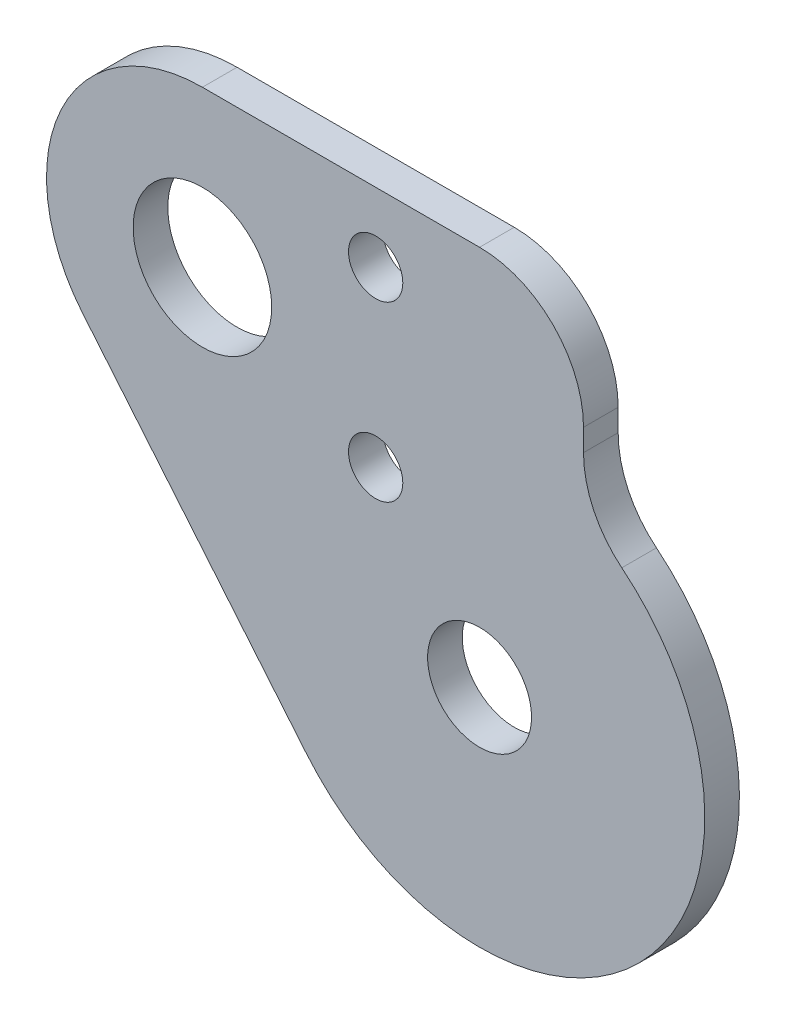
ISO-10303-21;
HEADER;
FILE_DESCRIPTION(('STEP AP214'),'2;1');
FILE_NAME('part.step','',(''),(''),'','','');
FILE_SCHEMA(('AUTOMOTIVE_DESIGN { 1 0 10303 214 1 1 1 1 }'));
ENDSEC;
DATA;
#1=APPLICATION_CONTEXT('core data for automotive mechanical design processes');
#2=APPLICATION_PROTOCOL_DEFINITION('international standard','automotive_design',2000,#1);
#3=PRODUCT_CONTEXT('',#1,'mechanical');
#4=PRODUCT('Part','Part','',(#3));
#5=PRODUCT_RELATED_PRODUCT_CATEGORY('part','',(#4));
#6=PRODUCT_DEFINITION_FORMATION('','',#4);
#7=PRODUCT_DEFINITION_CONTEXT('part definition',#1,'design');
#8=PRODUCT_DEFINITION('design','',#6,#7);
#9=PRODUCT_DEFINITION_SHAPE('','',#8);
#10=(LENGTH_UNIT() NAMED_UNIT(*) SI_UNIT(.MILLI.,.METRE.));
#11=(NAMED_UNIT(*) PLANE_ANGLE_UNIT() SI_UNIT($,.RADIAN.));
#12=(NAMED_UNIT(*) SI_UNIT($,.STERADIAN.) SOLID_ANGLE_UNIT());
#13=UNCERTAINTY_MEASURE_WITH_UNIT(LENGTH_MEASURE(1.E-05),#10,'distance_accuracy_value','');
#14=(GEOMETRIC_REPRESENTATION_CONTEXT(3) GLOBAL_UNCERTAINTY_ASSIGNED_CONTEXT((#13)) GLOBAL_UNIT_ASSIGNED_CONTEXT((#10,
#11,#12)) REPRESENTATION_CONTEXT('',''));
#15=CARTESIAN_POINT('',(0.,0.,0.));
#16=DIRECTION('',(0.,0.,1.));
#17=DIRECTION('',(1.,0.,0.));
#18=AXIS2_PLACEMENT_3D('',#15,#16,#17);
#19=CARTESIAN_POINT('',(-25.4,20.6375,3.175));
#20=DIRECTION('',(0.,0.,1.));
#21=DIRECTION('',(1.,0.,0.));
#22=AXIS2_PLACEMENT_3D('',#19,#20,#21);
#23=PLANE('',#22);
#24=CARTESIAN_POINT('',(-9.525,28.575,3.175));
#25=DIRECTION('',(0.,0.,1.));
#26=DIRECTION('',(1.,0.,0.));
#27=AXIS2_PLACEMENT_3D('',#24,#25,#26);
#28=CIRCLE('',#27,2.4892);
#29=CARTESIAN_POINT('',(-7.03579999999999,28.575,3.175));
#30=VERTEX_POINT('',#29);
#31=EDGE_CURVE('E280',#30,#30,#28,.T.);
#32=ORIENTED_EDGE('',*,*,#31,.F.);
#33=EDGE_LOOP('',(#32));
#34=FACE_BOUND('',#33,.T.);
#35=CARTESIAN_POINT('',(0.,0.,3.175));
#36=DIRECTION('',(0.,0.,1.));
#37=DIRECTION('',(1.,0.,0.));
#38=AXIS2_PLACEMENT_3D('',#35,#36,#37);
#39=CIRCLE('',#38,4.7625);
#40=CARTESIAN_POINT('',(4.7625,0.,3.175));
#41=VERTEX_POINT('',#40);
#42=EDGE_CURVE('E157',#41,#41,#39,.T.);
#43=ORIENTED_EDGE('',*,*,#42,.F.);
#44=EDGE_LOOP('',(#43));
#45=FACE_BOUND('',#44,.T.);
#46=DIRECTION('',(0.,1.,0.));
#47=VECTOR('',#46,1.);
#48=CARTESIAN_POINT('',(9.525,34.925,3.175));
#49=LINE('',#48,#47);
#50=CARTESIAN_POINT('',(9.525,23.3853352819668,3.175));
#51=VERTEX_POINT('',#50);
#52=CARTESIAN_POINT('',(9.525,25.4,3.175));
#53=VERTEX_POINT('',#52);
#54=EDGE_CURVE('E149',#51,#53,#49,.T.);
#55=ORIENTED_EDGE('',*,*,#54,.T.);
#56=CARTESIAN_POINT('',(0.,25.4,3.175));
#57=DIRECTION('',(0.,0.,1.));
#58=DIRECTION('',(1.,0.,0.));
#59=AXIS2_PLACEMENT_3D('',#56,#57,#58);
#60=CIRCLE('',#59,9.525);
#61=CARTESIAN_POINT('',(0.,34.925,3.175));
#62=VERTEX_POINT('',#61);
#63=EDGE_CURVE('E133',#53,#62,#60,.T.);
#64=ORIENTED_EDGE('',*,*,#63,.T.);
#65=DIRECTION('',(-1.,0.,0.));
#66=VECTOR('',#65,1.);
#67=CARTESIAN_POINT('',(-25.4,34.925,3.175));
#68=LINE('',#67,#66);
#69=CARTESIAN_POINT('',(-25.4,34.925,3.175));
#70=VERTEX_POINT('',#69);
#71=EDGE_CURVE('E110',#62,#70,#68,.T.);
#72=ORIENTED_EDGE('',*,*,#71,.T.);
#73=CARTESIAN_POINT('',(-25.4,20.6375,3.175));
#74=DIRECTION('',(0.,0.,1.));
#75=DIRECTION('',(1.,0.,0.));
#76=AXIS2_PLACEMENT_3D('',#73,#74,#75);
#77=CIRCLE('',#76,14.2875);
#78=CARTESIAN_POINT('',(-36.3899022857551,11.5076202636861,3.175));
#79=VERTEX_POINT('',#78);
#80=EDGE_CURVE('E105',#70,#79,#77,.T.);
#81=ORIENTED_EDGE('',*,*,#80,.T.);
#82=DIRECTION('',(0.63901170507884,-0.769197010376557,0.));
#83=VECTOR('',#82,1.);
#84=CARTESIAN_POINT('',(-36.3899022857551,11.5076202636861,3.175));
#85=LINE('',#84,#83);
#86=CARTESIAN_POINT('',(-15.8743033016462,-13.1876040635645,3.175));
#87=VERTEX_POINT('',#86);
#88=EDGE_CURVE('E95',#79,#87,#85,.T.);
#89=ORIENTED_EDGE('',*,*,#88,.T.);
#90=CARTESIAN_POINT('',(0.,0.,3.175));
#91=DIRECTION('',(0.,0.,1.));
#92=DIRECTION('',(1.,0.,0.));
#93=AXIS2_PLACEMENT_3D('',#90,#91,#92);
#94=CIRCLE('',#93,20.6375);
#95=CARTESIAN_POINT('',(13.0342105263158,16.0004925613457,3.175));
#96=VERTEX_POINT('',#95);
#97=EDGE_CURVE('E104',#87,#96,#94,.T.);
#98=ORIENTED_EDGE('',*,*,#97,.T.);
#99=CARTESIAN_POINT('',(19.05,23.3853352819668,3.175));
#100=DIRECTION('',(0.,0.,1.));
#101=DIRECTION('',(1.,0.,0.));
#102=AXIS2_PLACEMENT_3D('',#99,#100,#101);
#103=CIRCLE('',#102,9.525);
#104=EDGE_CURVE('E11',#96,#51,#103,.F.);
#105=ORIENTED_EDGE('',*,*,#104,.T.);
#106=EDGE_LOOP('',(#55,#64,#72,#81,#89,#98,#105));
#107=FACE_BOUND('',#106,.T.);
#108=CARTESIAN_POINT('',(-25.4,20.6375,3.175));
#109=DIRECTION('',(0.,0.,1.));
#110=DIRECTION('',(1.,0.,0.));
#111=AXIS2_PLACEMENT_3D('',#108,#109,#110);
#112=CIRCLE('',#111,6.35);
#113=CARTESIAN_POINT('',(-19.05,20.6375,3.175));
#114=VERTEX_POINT('',#113);
#115=EDGE_CURVE('E294',#114,#114,#112,.T.);
#116=ORIENTED_EDGE('',*,*,#115,.F.);
#117=EDGE_LOOP('',(#116));
#118=FACE_BOUND('',#117,.T.);
#119=CARTESIAN_POINT('',(-9.525,12.7,3.175));
#120=DIRECTION('',(0.,0.,1.));
#121=DIRECTION('',(1.,0.,0.));
#122=AXIS2_PLACEMENT_3D('',#119,#120,#121);
#123=CIRCLE('',#122,2.4892);
#124=CARTESIAN_POINT('',(-7.03579999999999,12.7,3.175));
#125=VERTEX_POINT('',#124);
#126=EDGE_CURVE('E285',#125,#125,#123,.T.);
#127=ORIENTED_EDGE('',*,*,#126,.F.);
#128=EDGE_LOOP('',(#127));
#129=FACE_BOUND('',#128,.T.);
#130=ADVANCED_FACE('F33',(#34,#45,#107,#118,#129),#23,.T.);
#131=CARTESIAN_POINT('',(-25.4,20.6375,0.));
#132=DIRECTION('',(0.,0.,1.));
#133=DIRECTION('',(1.,0.,0.));
#134=AXIS2_PLACEMENT_3D('',#131,#132,#133);
#135=PLANE('',#134);
#136=DIRECTION('',(-1.,0.,0.));
#137=VECTOR('',#136,1.);
#138=CARTESIAN_POINT('',(-25.4,34.925,0.));
#139=LINE('',#138,#137);
#140=CARTESIAN_POINT('',(0.,34.925,0.));
#141=VERTEX_POINT('',#140);
#142=CARTESIAN_POINT('',(-25.4,34.925,0.));
#143=VERTEX_POINT('',#142);
#144=EDGE_CURVE('E114',#141,#143,#139,.T.);
#145=ORIENTED_EDGE('',*,*,#144,.F.);
#146=CARTESIAN_POINT('',(0.,25.4,0.));
#147=DIRECTION('',(0.,0.,1.));
#148=DIRECTION('',(1.,0.,0.));
#149=AXIS2_PLACEMENT_3D('',#146,#147,#148);
#150=CIRCLE('',#149,9.525);
#151=CARTESIAN_POINT('',(9.525,25.4,0.));
#152=VERTEX_POINT('',#151);
#153=EDGE_CURVE('E122',#141,#152,#150,.F.);
#154=ORIENTED_EDGE('',*,*,#153,.T.);
#155=DIRECTION('',(0.,1.,0.));
#156=VECTOR('',#155,1.);
#157=CARTESIAN_POINT('',(9.525,34.925,0.));
#158=LINE('',#157,#156);
#159=CARTESIAN_POINT('',(9.525,23.3853352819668,0.));
#160=VERTEX_POINT('',#159);
#161=EDGE_CURVE('E142',#160,#152,#158,.T.);
#162=ORIENTED_EDGE('',*,*,#161,.F.);
#163=CARTESIAN_POINT('',(19.05,23.3853352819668,0.));
#164=DIRECTION('',(0.,0.,1.));
#165=DIRECTION('',(1.,0.,0.));
#166=AXIS2_PLACEMENT_3D('',#163,#164,#165);
#167=CIRCLE('',#166,9.525);
#168=CARTESIAN_POINT('',(13.0342105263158,16.0004925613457,0.));
#169=VERTEX_POINT('',#168);
#170=EDGE_CURVE('E41',#160,#169,#167,.T.);
#171=ORIENTED_EDGE('',*,*,#170,.T.);
#172=CARTESIAN_POINT('',(0.,0.,0.));
#173=DIRECTION('',(0.,0.,1.));
#174=DIRECTION('',(1.,0.,0.));
#175=AXIS2_PLACEMENT_3D('',#172,#173,#174);
#176=CIRCLE('',#175,20.6375);
#177=CARTESIAN_POINT('',(-15.8743033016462,-13.1876040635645,0.));
#178=VERTEX_POINT('',#177);
#179=EDGE_CURVE('E141',#178,#169,#176,.T.);
#180=ORIENTED_EDGE('',*,*,#179,.F.);
#181=DIRECTION('',(0.63901170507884,-0.769197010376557,0.));
#182=VECTOR('',#181,1.);
#183=CARTESIAN_POINT('',(-36.3899022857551,11.5076202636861,0.));
#184=LINE('',#183,#182);
#185=CARTESIAN_POINT('',(-36.3899022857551,11.5076202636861,0.));
#186=VERTEX_POINT('',#185);
#187=EDGE_CURVE('E146',#186,#178,#184,.T.);
#188=ORIENTED_EDGE('',*,*,#187,.F.);
#189=CARTESIAN_POINT('',(-25.4,20.6375,0.));
#190=DIRECTION('',(0.,0.,1.));
#191=DIRECTION('',(1.,0.,0.));
#192=AXIS2_PLACEMENT_3D('',#189,#190,#191);
#193=CIRCLE('',#192,14.2875);
#194=EDGE_CURVE('E118',#143,#186,#193,.T.);
#195=ORIENTED_EDGE('',*,*,#194,.F.);
#196=EDGE_LOOP('',(#145,#154,#162,#171,#180,#188,#195));
#197=FACE_BOUND('',#196,.T.);
#198=CARTESIAN_POINT('',(0.,0.,0.));
#199=DIRECTION('',(0.,0.,1.));
#200=DIRECTION('',(1.,0.,0.));
#201=AXIS2_PLACEMENT_3D('',#198,#199,#200);
#202=CIRCLE('',#201,4.7625);
#203=CARTESIAN_POINT('',(4.7625,0.,0.));
#204=VERTEX_POINT('',#203);
#205=EDGE_CURVE('E297',#204,#204,#202,.T.);
#206=ORIENTED_EDGE('',*,*,#205,.T.);
#207=EDGE_LOOP('',(#206));
#208=FACE_BOUND('',#207,.T.);
#209=CARTESIAN_POINT('',(-25.4,20.6375,0.));
#210=DIRECTION('',(0.,0.,1.));
#211=DIRECTION('',(1.,0.,0.));
#212=AXIS2_PLACEMENT_3D('',#209,#210,#211);
#213=CIRCLE('',#212,6.35);
#214=CARTESIAN_POINT('',(-19.05,20.6375,0.));
#215=VERTEX_POINT('',#214);
#216=EDGE_CURVE('E287',#215,#215,#213,.T.);
#217=ORIENTED_EDGE('',*,*,#216,.T.);
#218=EDGE_LOOP('',(#217));
#219=FACE_BOUND('',#218,.T.);
#220=CARTESIAN_POINT('',(-9.525,28.575,0.));
#221=DIRECTION('',(0.,0.,1.));
#222=DIRECTION('',(1.,0.,0.));
#223=AXIS2_PLACEMENT_3D('',#220,#221,#222);
#224=CIRCLE('',#223,2.4892);
#225=CARTESIAN_POINT('',(-7.03579999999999,28.575,0.));
#226=VERTEX_POINT('',#225);
#227=EDGE_CURVE('E283',#226,#226,#224,.T.);
#228=ORIENTED_EDGE('',*,*,#227,.T.);
#229=EDGE_LOOP('',(#228));
#230=FACE_BOUND('',#229,.T.);
#231=CARTESIAN_POINT('',(-9.525,12.7,0.));
#232=DIRECTION('',(0.,0.,1.));
#233=DIRECTION('',(1.,0.,0.));
#234=AXIS2_PLACEMENT_3D('',#231,#232,#233);
#235=CIRCLE('',#234,2.4892);
#236=CARTESIAN_POINT('',(-7.03579999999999,12.7,0.));
#237=VERTEX_POINT('',#236);
#238=EDGE_CURVE('E290',#237,#237,#235,.T.);
#239=ORIENTED_EDGE('',*,*,#238,.T.);
#240=EDGE_LOOP('',(#239));
#241=FACE_BOUND('',#240,.T.);
#242=ADVANCED_FACE('F139',(#197,#208,#219,#230,#241),#135,.F.);
#243=CARTESIAN_POINT('',(-25.4,20.6375,3.175));
#244=DIRECTION('',(0.,0.,-1.));
#245=DIRECTION('',(-1.,0.,0.));
#246=AXIS2_PLACEMENT_3D('',#243,#244,#245);
#247=CYLINDRICAL_SURFACE('',#246,14.2875);
#248=ORIENTED_EDGE('',*,*,#194,.T.);
#249=DIRECTION('',(0.,0.,-1.));
#250=VECTOR('',#249,1.);
#251=CARTESIAN_POINT('',(-36.3899022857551,11.5076202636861,3.175));
#252=LINE('',#251,#250);
#253=EDGE_CURVE('E99',#79,#186,#252,.T.);
#254=ORIENTED_EDGE('',*,*,#253,.F.);
#255=ORIENTED_EDGE('',*,*,#80,.F.);
#256=DIRECTION('',(0.,0.,-1.));
#257=VECTOR('',#256,1.);
#258=CARTESIAN_POINT('',(-25.4,34.925,3.175));
#259=LINE('',#258,#257);
#260=EDGE_CURVE('E124',#70,#143,#259,.T.);
#261=ORIENTED_EDGE('',*,*,#260,.T.);
#262=EDGE_LOOP('',(#248,#254,#255,#261));
#263=FACE_BOUND('',#262,.T.);
#264=ADVANCED_FACE('F116',(#263),#247,.T.);
#265=CARTESIAN_POINT('',(-36.3899022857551,11.5076202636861,3.175));
#266=DIRECTION('',(0.769197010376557,0.63901170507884,0.));
#267=DIRECTION('',(-0.63901170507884,0.769197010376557,0.));
#268=AXIS2_PLACEMENT_3D('',#265,#266,#267);
#269=PLANE('',#268);
#270=ORIENTED_EDGE('',*,*,#187,.T.);
#271=DIRECTION('',(0.,0.,-1.));
#272=VECTOR('',#271,1.);
#273=CARTESIAN_POINT('',(-15.8743033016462,-13.1876040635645,3.175));
#274=LINE('',#273,#272);
#275=EDGE_CURVE('E102',#87,#178,#274,.T.);
#276=ORIENTED_EDGE('',*,*,#275,.F.);
#277=ORIENTED_EDGE('',*,*,#88,.F.);
#278=ORIENTED_EDGE('',*,*,#253,.T.);
#279=EDGE_LOOP('',(#270,#276,#277,#278));
#280=FACE_BOUND('',#279,.T.);
#281=ADVANCED_FACE('F97',(#280),#269,.F.);
#282=CARTESIAN_POINT('',(0.,0.,3.175));
#283=DIRECTION('',(0.,0.,-1.));
#284=DIRECTION('',(-1.,0.,0.));
#285=AXIS2_PLACEMENT_3D('',#282,#283,#284);
#286=CYLINDRICAL_SURFACE('',#285,20.6375);
#287=ORIENTED_EDGE('',*,*,#179,.T.);
#288=DIRECTION('',(0.,0.,-1.));
#289=VECTOR('',#288,1.);
#290=CARTESIAN_POINT('',(13.0342105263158,16.0004925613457,3.175));
#291=LINE('',#290,#289);
#292=EDGE_CURVE('E48',#169,#96,#291,.F.);
#293=ORIENTED_EDGE('',*,*,#292,.T.);
#294=ORIENTED_EDGE('',*,*,#97,.F.);
#295=ORIENTED_EDGE('',*,*,#275,.T.);
#296=EDGE_LOOP('',(#287,#293,#294,#295));
#297=FACE_BOUND('',#296,.T.);
#298=ADVANCED_FACE('F145',(#297),#286,.T.);
#299=CARTESIAN_POINT('',(9.525,34.925,3.175));
#300=DIRECTION('',(-1.,0.,0.));
#301=DIRECTION('',(0.,-1.,0.));
#302=AXIS2_PLACEMENT_3D('',#299,#300,#301);
#303=PLANE('',#302);
#304=ORIENTED_EDGE('',*,*,#161,.T.);
#305=DIRECTION('',(0.,0.,-1.));
#306=VECTOR('',#305,1.);
#307=CARTESIAN_POINT('',(9.525,25.4,3.175));
#308=LINE('',#307,#306);
#309=EDGE_CURVE('E56',#152,#53,#308,.F.);
#310=ORIENTED_EDGE('',*,*,#309,.T.);
#311=ORIENTED_EDGE('',*,*,#54,.F.);
#312=DIRECTION('',(0.,0.,1.));
#313=VECTOR('',#312,1.);
#314=CARTESIAN_POINT('',(9.525,23.3853352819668,0.));
#315=LINE('',#314,#313);
#316=EDGE_CURVE('E129',#51,#160,#315,.F.);
#317=ORIENTED_EDGE('',*,*,#316,.T.);
#318=EDGE_LOOP('',(#304,#310,#311,#317));
#319=FACE_BOUND('',#318,.T.);
#320=ADVANCED_FACE('F151',(#319),#303,.F.);
#321=CARTESIAN_POINT('',(-25.4,34.925,3.175));
#322=DIRECTION('',(0.,-1.,0.));
#323=DIRECTION('',(1.,0.,0.));
#324=AXIS2_PLACEMENT_3D('',#321,#322,#323);
#325=PLANE('',#324);
#326=ORIENTED_EDGE('',*,*,#71,.F.);
#327=DIRECTION('',(0.,0.,-1.));
#328=VECTOR('',#327,1.);
#329=CARTESIAN_POINT('',(0.,34.925,3.175));
#330=LINE('',#329,#328);
#331=EDGE_CURVE('E119',#62,#141,#330,.T.);
#332=ORIENTED_EDGE('',*,*,#331,.T.);
#333=ORIENTED_EDGE('',*,*,#144,.T.);
#334=ORIENTED_EDGE('',*,*,#260,.F.);
#335=EDGE_LOOP('',(#326,#332,#333,#334));
#336=FACE_BOUND('',#335,.T.);
#337=ADVANCED_FACE('F161',(#336),#325,.F.);
#338=CARTESIAN_POINT('',(0.,0.,3.175));
#339=DIRECTION('',(0.,0.,-1.));
#340=DIRECTION('',(-1.,0.,0.));
#341=AXIS2_PLACEMENT_3D('',#338,#339,#340);
#342=CYLINDRICAL_SURFACE('',#341,4.7625);
#343=ORIENTED_EDGE('',*,*,#42,.T.);
#344=EDGE_LOOP('',(#343));
#345=FACE_BOUND('',#344,.T.);
#346=ORIENTED_EDGE('',*,*,#205,.F.);
#347=EDGE_LOOP('',(#346));
#348=FACE_BOUND('',#347,.T.);
#349=ADVANCED_FACE('F185',(#345,#348),#342,.F.);
#350=CARTESIAN_POINT('',(-25.4,20.6375,3.175));
#351=DIRECTION('',(0.,0.,-1.));
#352=DIRECTION('',(-1.,0.,0.));
#353=AXIS2_PLACEMENT_3D('',#350,#351,#352);
#354=CYLINDRICAL_SURFACE('',#353,6.35);
#355=ORIENTED_EDGE('',*,*,#115,.T.);
#356=EDGE_LOOP('',(#355));
#357=FACE_BOUND('',#356,.T.);
#358=ORIENTED_EDGE('',*,*,#216,.F.);
#359=EDGE_LOOP('',(#358));
#360=FACE_BOUND('',#359,.T.);
#361=ADVANCED_FACE('F222',(#357,#360),#354,.F.);
#362=CARTESIAN_POINT('',(-9.525,28.575,3.175));
#363=DIRECTION('',(0.,0.,-1.));
#364=DIRECTION('',(-1.,0.,0.));
#365=AXIS2_PLACEMENT_3D('',#362,#363,#364);
#366=CYLINDRICAL_SURFACE('',#365,2.4892);
#367=ORIENTED_EDGE('',*,*,#31,.T.);
#368=EDGE_LOOP('',(#367));
#369=FACE_BOUND('',#368,.T.);
#370=ORIENTED_EDGE('',*,*,#227,.F.);
#371=EDGE_LOOP('',(#370));
#372=FACE_BOUND('',#371,.T.);
#373=ADVANCED_FACE('F171',(#369,#372),#366,.F.);
#374=CARTESIAN_POINT('',(-9.525,12.7,3.175));
#375=DIRECTION('',(0.,0.,-1.));
#376=DIRECTION('',(-1.,0.,0.));
#377=AXIS2_PLACEMENT_3D('',#374,#375,#376);
#378=CYLINDRICAL_SURFACE('',#377,2.4892);
#379=ORIENTED_EDGE('',*,*,#126,.T.);
#380=EDGE_LOOP('',(#379));
#381=FACE_BOUND('',#380,.T.);
#382=ORIENTED_EDGE('',*,*,#238,.F.);
#383=EDGE_LOOP('',(#382));
#384=FACE_BOUND('',#383,.T.);
#385=ADVANCED_FACE('F166',(#381,#384),#378,.F.);
#386=CARTESIAN_POINT('',(0.,25.4,3.175));
#387=DIRECTION('',(0.,0.,-1.));
#388=DIRECTION('',(-1.,0.,0.));
#389=AXIS2_PLACEMENT_3D('',#386,#387,#388);
#390=CYLINDRICAL_SURFACE('',#389,9.525);
#391=ORIENTED_EDGE('',*,*,#63,.F.);
#392=ORIENTED_EDGE('',*,*,#309,.F.);
#393=ORIENTED_EDGE('',*,*,#153,.F.);
#394=ORIENTED_EDGE('',*,*,#331,.F.);
#395=EDGE_LOOP('',(#391,#392,#393,#394));
#396=FACE_BOUND('',#395,.T.);
#397=ADVANCED_FACE('F164',(#396),#390,.T.);
#398=CARTESIAN_POINT('',(19.05,23.3853352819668,3.175));
#399=DIRECTION('',(0.,0.,-1.));
#400=DIRECTION('',(-1.,0.,0.));
#401=AXIS2_PLACEMENT_3D('',#398,#399,#400);
#402=CYLINDRICAL_SURFACE('',#401,9.525);
#403=ORIENTED_EDGE('',*,*,#104,.F.);
#404=ORIENTED_EDGE('',*,*,#292,.F.);
#405=ORIENTED_EDGE('',*,*,#170,.F.);
#406=ORIENTED_EDGE('',*,*,#316,.F.);
#407=EDGE_LOOP('',(#403,#404,#405,#406));
#408=FACE_BOUND('',#407,.T.);
#409=ADVANCED_FACE('F35',(#408),#402,.F.);
#410=CLOSED_SHELL('',(#130,#242,#264,#281,#298,#320,#337,#349,#361,#373,#385,#397,#409));
#411=MANIFOLD_SOLID_BREP('B2',#410);
#412=ADVANCED_BREP_SHAPE_REPRESENTATION('',(#18,#411),#14);
#413=SHAPE_DEFINITION_REPRESENTATION(#9,#412);
ENDSEC;
END-ISO-10303-21;
